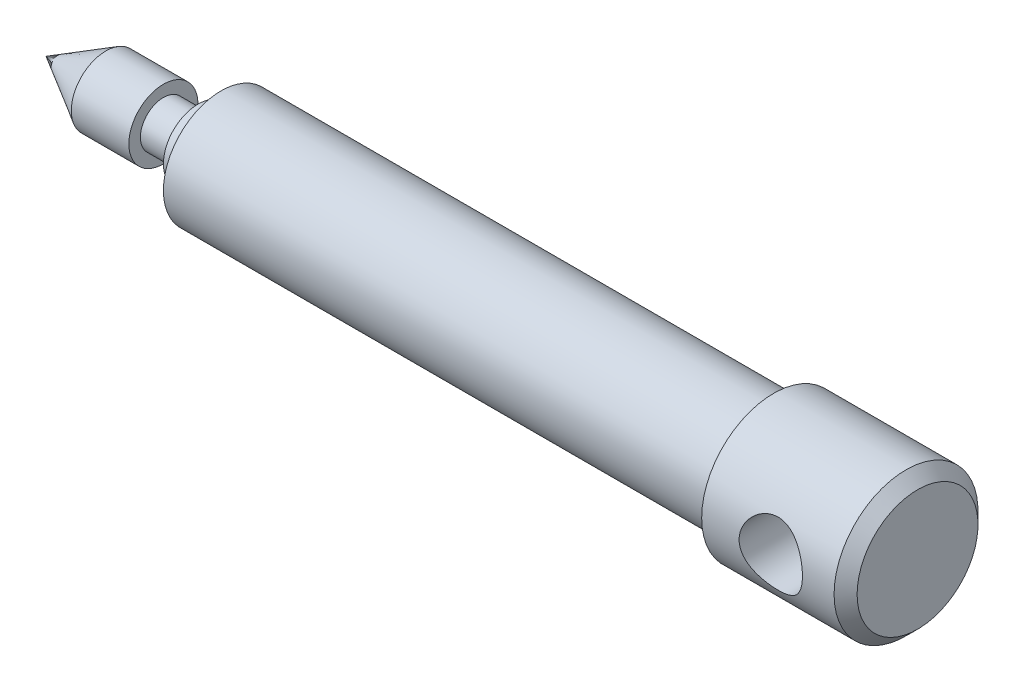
from build123d import *

# Parameters (mm, degrees)
CHAMFER1_SIZE  = 2
SKETCH2_R      = 5.5
EXTRUDE1_DEPTH = 15


with BuildPart() as part:
    # Sketch1 → Revolve1 (revolve)
    with BuildSketch(Plane.XY, mode=Mode.PRIVATE) as revolve1_sk:
        Polygon((0, 0), (10.392304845, 6), (20.392304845, 6), (20.392304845, 4), (26.392304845, 4), (26.392304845, 6), (30.392304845, 6), (30.392304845, 10), (126.392304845, 10), (126.392304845, 12.5), (151.392304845, 12.5), (151.392304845, 0), align=None)
    revolve(revolve1_sk.sketch.rotate(Axis((0, 0, 0), (1, 0, 0)), 90), axis=Axis((0, 0, 0), (1, 0, 0)))

    # Chamfer1
    chamfer1_edges = [part.edges().sort_by_distance(p)[0] for p in [
        (151.392304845, 0, -12.5),
    ]]
    chamfer(chamfer1_edges, length=CHAMFER1_SIZE)

    # Sketch2 → Extrude1 (cut, symmetric)
    with BuildSketch(Plane.XY):
        with Locations((138.392304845, 0)):
            Circle(SKETCH2_R)
    extrude(amount=EXTRUDE1_DEPTH, both=True, mode=Mode.SUBTRACT)


solid = part.part
